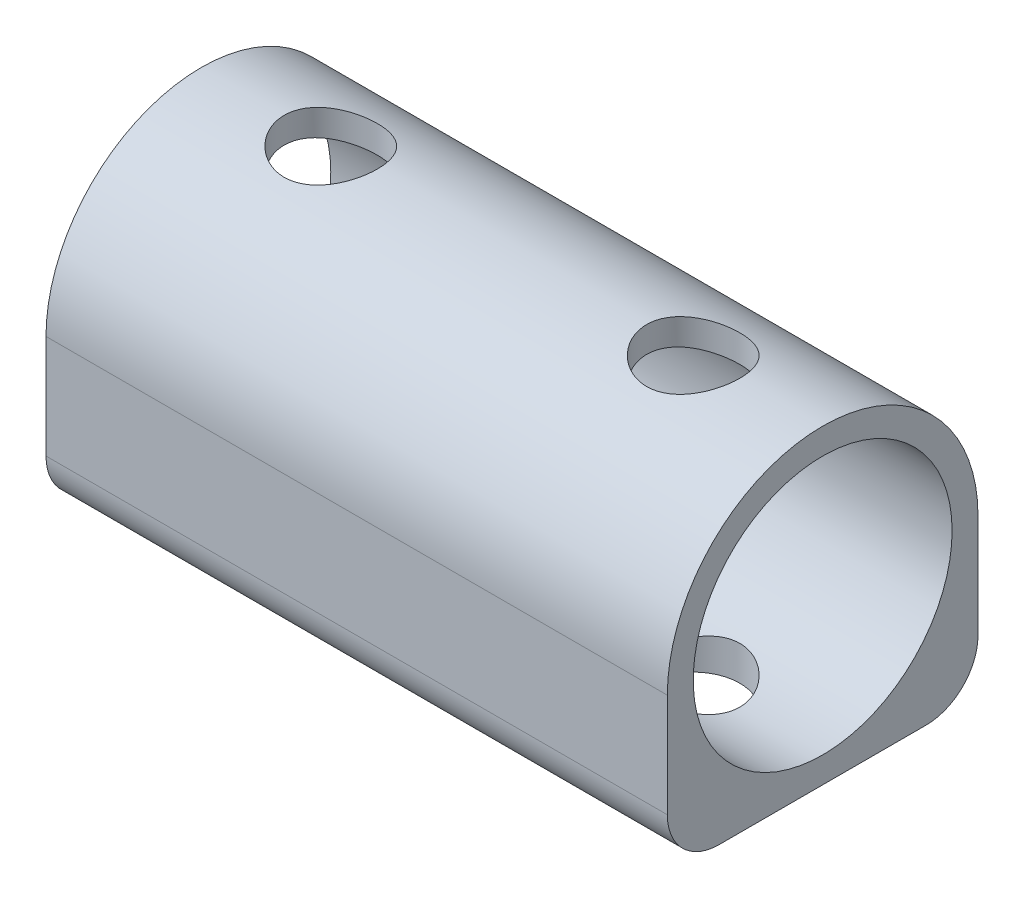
from build123d import *

# Parameters (mm, degrees)
BASE_EXTRUDE_DEPTH = 76.2
SKETCH3_R          = 15.875
CUT_EXTRUDE2_DEPTH = 81.82230509
SKETCH2_R          = 5.715
CUT_EXTRUDE1_DEPTH = 88.298066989
FILLET1_R          = 6.35


with BuildPart() as part:
    # Sketch1 → Base-Extrude (new body)
    with BuildSketch(Plane(origin=(0, 0, 0), x_dir=(0, 0, -1), z_dir=(1, 0, 0))):
        with BuildLine():
            Line((19.05, 0), (19.05, -19.05))
            Line((19.05, -19.05), (-19.05, -19.05))
            Line((-19.05, -19.05), (-19.05, 0))
            ThreePointArc((-19.05, 0), (0, 19.05), (19.05, 0))
        make_face()
    extrude(amount=-BASE_EXTRUDE_DEPTH)

    # Sketch3 → Cut-Extrude2 (cut, through all)
    with BuildSketch(Plane(origin=(0, 0, 0), x_dir=(0, 0, -1), z_dir=(1, 0, 0))):
        Circle(SKETCH3_R)
    extrude(amount=-CUT_EXTRUDE2_DEPTH, mode=Mode.SUBTRACT)

    # Sketch2 → Cut-Extrude1 (cut, through all)
    with BuildSketch(Plane.XZ.offset(19.05)):
        with Locations((-15.875, 0)):
            Circle(SKETCH2_R)
        with Locations((-60.325, 0)):
            Circle(SKETCH2_R)
    extrude(amount=-CUT_EXTRUDE1_DEPTH, mode=Mode.SUBTRACT)

    # Fillet1
    fillet1_edges = [part.edges().sort_by_distance(p)[0] for p in [
        (-38.1, -19.05, 19.05),
        (-38.1, -19.05, -19.05),
    ]]
    fillet(fillet1_edges, radius=FILLET1_R)


solid = part.part
